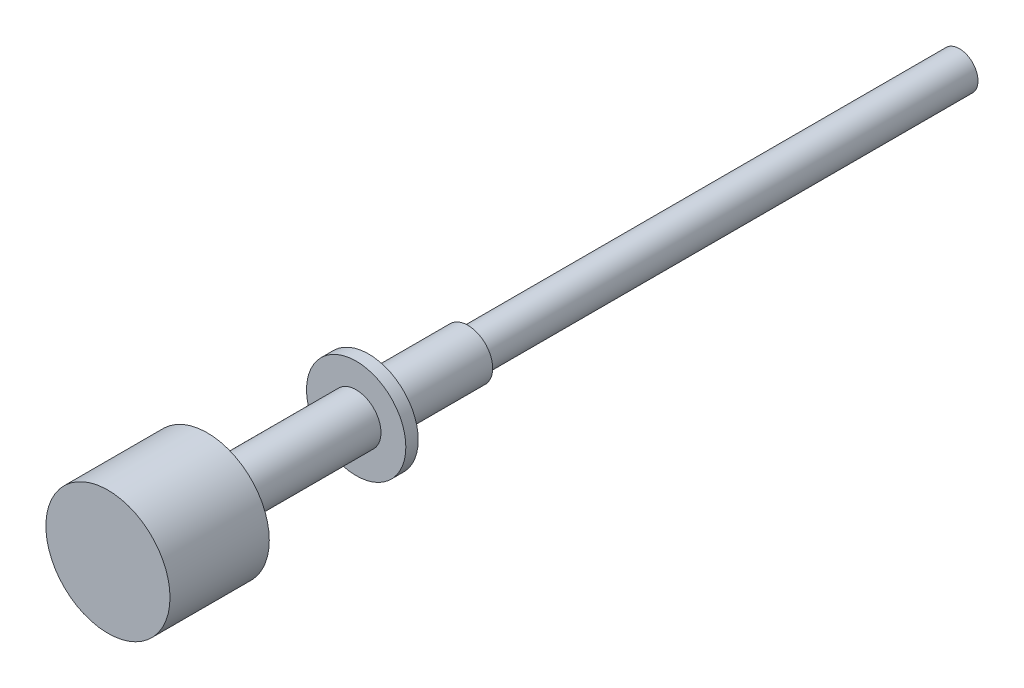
from build123d import *

# Parameters (mm, degrees)
SKETCH2_R           = 4.7625
BOSS_EXTRUDE2_DEPTH = 125.73
SKETCH3_R           = 6.35
BOSS_EXTRUDE3_DEPTH = 25.4
SKETCH4_R           = 12.7
BOSS_EXTRUDE4_DEPTH = 3.175
SKETCH5_R           = 6.35
BOSS_EXTRUDE5_DEPTH = 38.1
SKETCH6_R           = 15.875
BOSS_EXTRUDE6_DEPTH = 25.4


with BuildPart() as part:
    # Sketch2 → Boss-Extrude2 (new body)
    with BuildSketch(Plane.XY):
        Circle(SKETCH2_R)
    extrude(amount=BOSS_EXTRUDE2_DEPTH)

    # Sketch3 → Boss-Extrude3 (add)
    with BuildSketch(Plane.XY.offset(125.73)):
        Circle(SKETCH3_R)
    extrude(amount=BOSS_EXTRUDE3_DEPTH)

    # Sketch4 → Boss-Extrude4 (add)
    with BuildSketch(Plane.XY.offset(151.13)):
        Circle(SKETCH4_R)
    extrude(amount=BOSS_EXTRUDE4_DEPTH)

    # Sketch5 → Boss-Extrude5 (add)
    with BuildSketch(Plane.XY.offset(154.305)):
        Circle(SKETCH5_R)
    extrude(amount=BOSS_EXTRUDE5_DEPTH)

    # Sketch6 → Boss-Extrude6 (add)
    with BuildSketch(Plane.XY.offset(192.405)):
        Circle(SKETCH6_R)
    extrude(amount=BOSS_EXTRUDE6_DEPTH)


solid = part.part
